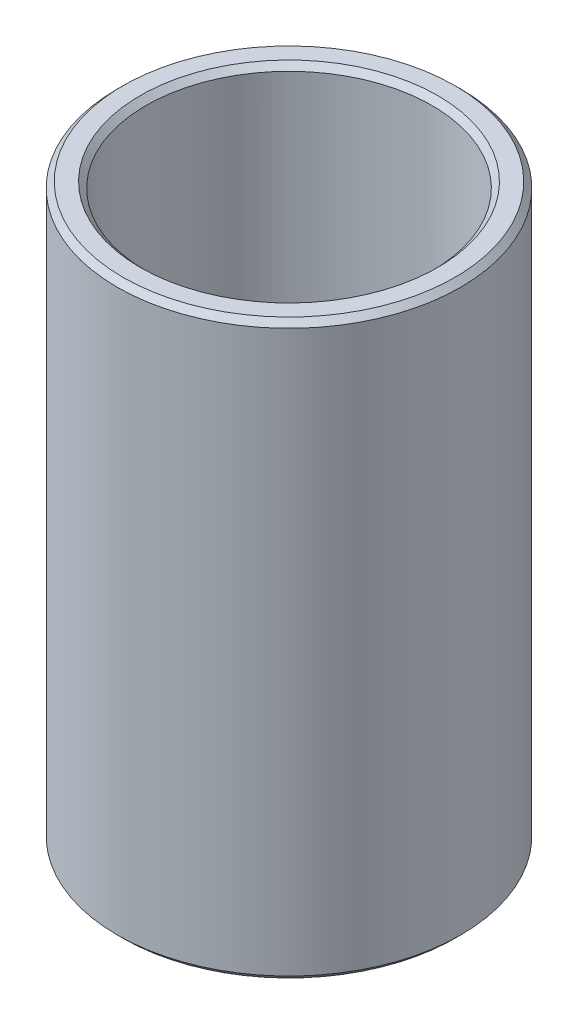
ISO-10303-21;
HEADER;
FILE_DESCRIPTION(('STEP AP214'),'2;1');
FILE_NAME('part.step','',(''),(''),'','','');
FILE_SCHEMA(('AUTOMOTIVE_DESIGN { 1 0 10303 214 1 1 1 1 }'));
ENDSEC;
DATA;
#1=APPLICATION_CONTEXT('core data for automotive mechanical design processes');
#2=APPLICATION_PROTOCOL_DEFINITION('international standard','automotive_design',2000,#1);
#3=PRODUCT_CONTEXT('',#1,'mechanical');
#4=PRODUCT('Part','Part','',(#3));
#5=PRODUCT_RELATED_PRODUCT_CATEGORY('part','',(#4));
#6=PRODUCT_DEFINITION_FORMATION('','',#4);
#7=PRODUCT_DEFINITION_CONTEXT('part definition',#1,'design');
#8=PRODUCT_DEFINITION('design','',#6,#7);
#9=PRODUCT_DEFINITION_SHAPE('','',#8);
#10=(LENGTH_UNIT() NAMED_UNIT(*) SI_UNIT(.MILLI.,.METRE.));
#11=(NAMED_UNIT(*) PLANE_ANGLE_UNIT() SI_UNIT($,.RADIAN.));
#12=(NAMED_UNIT(*) SI_UNIT($,.STERADIAN.) SOLID_ANGLE_UNIT());
#13=UNCERTAINTY_MEASURE_WITH_UNIT(LENGTH_MEASURE(1.E-05),#10,'distance_accuracy_value','');
#14=(GEOMETRIC_REPRESENTATION_CONTEXT(3) GLOBAL_UNCERTAINTY_ASSIGNED_CONTEXT((#13)) GLOBAL_UNIT_ASSIGNED_CONTEXT((#10,
#11,#12)) REPRESENTATION_CONTEXT('',''));
#15=CARTESIAN_POINT('',(0.,0.,0.));
#16=DIRECTION('',(0.,0.,1.));
#17=DIRECTION('',(1.,0.,0.));
#18=AXIS2_PLACEMENT_3D('',#15,#16,#17);
#19=CARTESIAN_POINT('',(0.,0.,0.));
#20=DIRECTION('',(0.,1.,0.));
#21=DIRECTION('',(0.,0.,1.));
#22=AXIS2_PLACEMENT_3D('',#19,#20,#21);
#23=CYLINDRICAL_SURFACE('',#22,5.);
#24=CARTESIAN_POINT('',(0.,19.7999999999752,0.));
#25=DIRECTION('',(0.,1.,0.));
#26=DIRECTION('',(0.,0.,1.));
#27=AXIS2_PLACEMENT_3D('',#24,#25,#26);
#28=CIRCLE('',#27,4.99999999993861);
#29=CARTESIAN_POINT('',(0.,19.7999999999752,4.99999999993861));
#30=VERTEX_POINT('',#29);
#31=EDGE_CURVE('E33',#30,#30,#28,.T.);
#32=ORIENTED_EDGE('',*,*,#31,.T.);
#33=EDGE_LOOP('',(#32));
#34=FACE_BOUND('',#33,.T.);
#35=CARTESIAN_POINT('',(0.,0.200000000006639,0.));
#36=DIRECTION('',(0.,-1.,0.));
#37=DIRECTION('',(0.,0.,-1.));
#38=AXIS2_PLACEMENT_3D('',#35,#36,#37);
#39=CIRCLE('',#38,4.99999999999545);
#40=CARTESIAN_POINT('',(0.,0.200000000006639,-4.99999999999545));
#41=VERTEX_POINT('',#40);
#42=EDGE_CURVE('E36',#41,#41,#39,.T.);
#43=ORIENTED_EDGE('',*,*,#42,.T.);
#44=EDGE_LOOP('',(#43));
#45=FACE_BOUND('',#44,.T.);
#46=ADVANCED_FACE('F14',(#34,#45),#23,.F.);
#47=CARTESIAN_POINT('',(0.,0.,0.));
#48=DIRECTION('',(0.,-1.,0.));
#49=DIRECTION('',(0.,0.,-1.));
#50=AXIS2_PLACEMENT_3D('',#47,#48,#49);
#51=CONICAL_SURFACE('',#50,5.20000000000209,0.785398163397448);
#52=ORIENTED_EDGE('',*,*,#42,.F.);
#53=EDGE_LOOP('',(#52));
#54=FACE_BOUND('',#53,.T.);
#55=CARTESIAN_POINT('',(0.,0.,0.));
#56=DIRECTION('',(0.,-1.,0.));
#57=DIRECTION('',(0.,0.,-1.));
#58=AXIS2_PLACEMENT_3D('',#55,#56,#57);
#59=CIRCLE('',#58,5.20000000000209);
#60=CARTESIAN_POINT('',(0.,0.,-5.20000000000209));
#61=VERTEX_POINT('',#60);
#62=EDGE_CURVE('E17',#61,#61,#59,.T.);
#63=ORIENTED_EDGE('',*,*,#62,.T.);
#64=EDGE_LOOP('',(#63));
#65=FACE_BOUND('',#64,.T.);
#66=ADVANCED_FACE('F54',(#54,#65),#51,.F.);
#67=CARTESIAN_POINT('',(0.,19.999999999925,0.));
#68=DIRECTION('',(0.,1.,0.));
#69=DIRECTION('',(0.,0.,1.));
#70=AXIS2_PLACEMENT_3D('',#67,#68,#69);
#71=CONICAL_SURFACE('',#70,5.19999999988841,0.785398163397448);
#72=CARTESIAN_POINT('',(0.,19.9999999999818,0.));
#73=DIRECTION('',(0.,1.,0.));
#74=DIRECTION('',(0.,0.,1.));
#75=AXIS2_PLACEMENT_3D('',#72,#73,#74);
#76=CIRCLE('',#75,5.19999999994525);
#77=CARTESIAN_POINT('',(0.,19.9999999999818,5.19999999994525));
#78=VERTEX_POINT('',#77);
#79=EDGE_CURVE('E47',#78,#78,#76,.T.);
#80=ORIENTED_EDGE('',*,*,#79,.T.);
#81=EDGE_LOOP('',(#80));
#82=FACE_BOUND('',#81,.T.);
#83=ORIENTED_EDGE('',*,*,#31,.F.);
#84=EDGE_LOOP('',(#83));
#85=FACE_BOUND('',#84,.T.);
#86=ADVANCED_FACE('F59',(#82,#85),#71,.F.);
#87=CARTESIAN_POINT('',(5.8,0.,0.));
#88=DIRECTION('',(0.,1.,0.));
#89=DIRECTION('',(0.,0.,1.));
#90=AXIS2_PLACEMENT_3D('',#87,#88,#89);
#91=PLANE('',#90);
#92=CARTESIAN_POINT('',(0.,5.6843418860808E-11,0.));
#93=DIRECTION('',(0.,1.,0.));
#94=DIRECTION('',(0.,0.,1.));
#95=AXIS2_PLACEMENT_3D('',#92,#93,#94);
#96=CIRCLE('',#95,5.80000000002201);
#97=CARTESIAN_POINT('',(0.,5.6843418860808E-11,5.80000000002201));
#98=VERTEX_POINT('',#97);
#99=EDGE_CURVE('E45',#98,#98,#96,.T.);
#100=ORIENTED_EDGE('',*,*,#99,.F.);
#101=EDGE_LOOP('',(#100));
#102=FACE_BOUND('',#101,.T.);
#103=ORIENTED_EDGE('',*,*,#62,.F.);
#104=EDGE_LOOP('',(#103));
#105=FACE_BOUND('',#104,.T.);
#106=ADVANCED_FACE('F56',(#102,#105),#91,.F.);
#107=CARTESIAN_POINT('',(0.,20.,0.));
#108=DIRECTION('',(0.,-1.,0.));
#109=DIRECTION('',(0.,0.,-1.));
#110=AXIS2_PLACEMENT_3D('',#107,#108,#109);
#111=PLANE('',#110);
#112=ORIENTED_EDGE('',*,*,#79,.F.);
#113=EDGE_LOOP('',(#112));
#114=FACE_BOUND('',#113,.T.);
#115=CARTESIAN_POINT('',(0.,19.9999999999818,0.));
#116=DIRECTION('',(0.,-1.,0.));
#117=DIRECTION('',(0.,0.,-1.));
#118=AXIS2_PLACEMENT_3D('',#115,#116,#117);
#119=CIRCLE('',#118,5.80000000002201);
#120=CARTESIAN_POINT('',(0.,19.9999999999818,-5.80000000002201));
#121=VERTEX_POINT('',#120);
#122=EDGE_CURVE('E26',#121,#121,#119,.T.);
#123=ORIENTED_EDGE('',*,*,#122,.F.);
#124=EDGE_LOOP('',(#123));
#125=FACE_BOUND('',#124,.T.);
#126=ADVANCED_FACE('F58',(#114,#125),#111,.F.);
#127=CARTESIAN_POINT('',(0.,0.200000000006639,0.));
#128=DIRECTION('',(0.,1.,0.));
#129=DIRECTION('',(0.,0.,1.));
#130=AXIS2_PLACEMENT_3D('',#127,#128,#129);
#131=CONICAL_SURFACE('',#130,5.99999999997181,0.785398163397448);
#132=CARTESIAN_POINT('',(0.,0.199999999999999,0.));
#133=DIRECTION('',(0.,1.,0.));
#134=DIRECTION('',(0.,0.,1.));
#135=AXIS2_PLACEMENT_3D('',#132,#133,#134);
#136=CIRCLE('',#135,6.);
#137=CARTESIAN_POINT('',(0.,0.199999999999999,6.));
#138=VERTEX_POINT('',#137);
#139=EDGE_CURVE('E21',#138,#138,#136,.T.);
#140=ORIENTED_EDGE('',*,*,#139,.F.);
#141=EDGE_LOOP('',(#140));
#142=FACE_BOUND('',#141,.T.);
#143=ORIENTED_EDGE('',*,*,#99,.T.);
#144=EDGE_LOOP('',(#143));
#145=FACE_BOUND('',#144,.T.);
#146=ADVANCED_FACE('F67',(#142,#145),#131,.T.);
#147=CARTESIAN_POINT('',(0.,19.8000000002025,0.));
#148=DIRECTION('',(0.,-1.,0.));
#149=DIRECTION('',(0.,0.,-1.));
#150=AXIS2_PLACEMENT_3D('',#147,#148,#149);
#151=CONICAL_SURFACE('',#150,5.99999999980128,0.785398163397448);
#152=ORIENTED_EDGE('',*,*,#122,.T.);
#153=EDGE_LOOP('',(#152));
#154=FACE_BOUND('',#153,.T.);
#155=CARTESIAN_POINT('',(0.,19.8,0.));
#156=DIRECTION('',(0.,1.,0.));
#157=DIRECTION('',(0.,0.,1.));
#158=AXIS2_PLACEMENT_3D('',#155,#156,#157);
#159=CIRCLE('',#158,6.);
#160=CARTESIAN_POINT('',(0.,19.8,6.));
#161=VERTEX_POINT('',#160);
#162=EDGE_CURVE('E10',#161,#161,#159,.F.);
#163=ORIENTED_EDGE('',*,*,#162,.F.);
#164=EDGE_LOOP('',(#163));
#165=FACE_BOUND('',#164,.T.);
#166=ADVANCED_FACE('F74',(#154,#165),#151,.T.);
#167=CARTESIAN_POINT('',(0.,0.,0.));
#168=DIRECTION('',(0.,1.,0.));
#169=DIRECTION('',(0.,0.,1.));
#170=AXIS2_PLACEMENT_3D('',#167,#168,#169);
#171=CYLINDRICAL_SURFACE('',#170,6.);
#172=ORIENTED_EDGE('',*,*,#162,.T.);
#173=EDGE_LOOP('',(#172));
#174=FACE_BOUND('',#173,.T.);
#175=ORIENTED_EDGE('',*,*,#139,.T.);
#176=EDGE_LOOP('',(#175));
#177=FACE_BOUND('',#176,.T.);
#178=ADVANCED_FACE('F72',(#174,#177),#171,.T.);
#179=CLOSED_SHELL('',(#46,#66,#86,#106,#126,#146,#166,#178));
#180=MANIFOLD_SOLID_BREP('B1',#179);
#181=ADVANCED_BREP_SHAPE_REPRESENTATION('',(#18,#180),#14);
#182=SHAPE_DEFINITION_REPRESENTATION(#9,#181);
ENDSEC;
END-ISO-10303-21;
